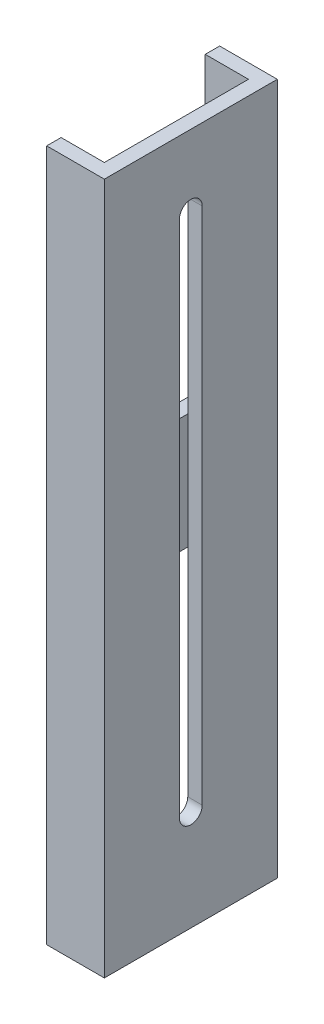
ISO-10303-21;
HEADER;
FILE_DESCRIPTION(('STEP AP214'),'2;1');
FILE_NAME('part.step','',(''),(''),'','','');
FILE_SCHEMA(('AUTOMOTIVE_DESIGN { 1 0 10303 214 1 1 1 1 }'));
ENDSEC;
DATA;
#1=APPLICATION_CONTEXT('core data for automotive mechanical design processes');
#2=APPLICATION_PROTOCOL_DEFINITION('international standard','automotive_design',2000,#1);
#3=PRODUCT_CONTEXT('',#1,'mechanical');
#4=PRODUCT('Part','Part','',(#3));
#5=PRODUCT_RELATED_PRODUCT_CATEGORY('part','',(#4));
#6=PRODUCT_DEFINITION_FORMATION('','',#4);
#7=PRODUCT_DEFINITION_CONTEXT('part definition',#1,'design');
#8=PRODUCT_DEFINITION('design','',#6,#7);
#9=PRODUCT_DEFINITION_SHAPE('','',#8);
#10=(LENGTH_UNIT() NAMED_UNIT(*) SI_UNIT(.MILLI.,.METRE.));
#11=(NAMED_UNIT(*) PLANE_ANGLE_UNIT() SI_UNIT($,.RADIAN.));
#12=(NAMED_UNIT(*) SI_UNIT($,.STERADIAN.) SOLID_ANGLE_UNIT());
#13=UNCERTAINTY_MEASURE_WITH_UNIT(LENGTH_MEASURE(1.E-05),#10,'distance_accuracy_value','');
#14=(GEOMETRIC_REPRESENTATION_CONTEXT(3) GLOBAL_UNCERTAINTY_ASSIGNED_CONTEXT((#13)) GLOBAL_UNIT_ASSIGNED_CONTEXT((#10,
#11,#12)) REPRESENTATION_CONTEXT('',''));
#15=CARTESIAN_POINT('',(0.,0.,0.));
#16=DIRECTION('',(0.,0.,1.));
#17=DIRECTION('',(1.,0.,0.));
#18=AXIS2_PLACEMENT_3D('',#15,#16,#17);
#19=CARTESIAN_POINT('',(-12.7,76.2,-15.875));
#20=DIRECTION('',(0.,0.,-1.));
#21=DIRECTION('',(-1.,0.,0.));
#22=AXIS2_PLACEMENT_3D('',#19,#20,#21);
#23=PLANE('',#22);
#24=DIRECTION('',(-1.,0.,0.));
#25=VECTOR('',#24,1.);
#26=CARTESIAN_POINT('',(-12.7,12.7,-15.875));
#27=LINE('',#26,#25);
#28=CARTESIAN_POINT('',(-9.525,12.7,-15.875));
#29=VERTEX_POINT('',#28);
#30=CARTESIAN_POINT('',(-12.7,12.7,-15.875));
#31=VERTEX_POINT('',#30);
#32=EDGE_CURVE('E57',#29,#31,#27,.T.);
#33=ORIENTED_EDGE('',*,*,#32,.F.);
#34=DIRECTION('',(0.,1.,0.));
#35=VECTOR('',#34,1.);
#36=CARTESIAN_POINT('',(-9.525,76.2,-15.875));
#37=LINE('',#36,#35);
#38=CARTESIAN_POINT('',(-9.525,-12.7,-15.875));
#39=VERTEX_POINT('',#38);
#40=EDGE_CURVE('E285',#39,#29,#37,.T.);
#41=ORIENTED_EDGE('',*,*,#40,.F.);
#42=DIRECTION('',(1.,0.,0.));
#43=VECTOR('',#42,1.);
#44=CARTESIAN_POINT('',(-12.7,-12.7,-15.875));
#45=LINE('',#44,#43);
#46=CARTESIAN_POINT('',(-12.7,-12.7,-15.875));
#47=VERTEX_POINT('',#46);
#48=EDGE_CURVE('E65',#47,#39,#45,.T.);
#49=ORIENTED_EDGE('',*,*,#48,.F.);
#50=DIRECTION('',(0.,-1.,0.));
#51=VECTOR('',#50,1.);
#52=CARTESIAN_POINT('',(-12.7,76.2,-15.875));
#53=LINE('',#52,#51);
#54=CARTESIAN_POINT('',(-12.7,-76.2,-15.875));
#55=VERTEX_POINT('',#54);
#56=EDGE_CURVE('E186',#47,#55,#53,.T.);
#57=ORIENTED_EDGE('',*,*,#56,.T.);
#58=DIRECTION('',(1.,0.,0.));
#59=VECTOR('',#58,1.);
#60=CARTESIAN_POINT('',(-12.7,-76.2,-15.875));
#61=LINE('',#60,#59);
#62=CARTESIAN_POINT('',(-3.175,-76.2,-15.875));
#63=VERTEX_POINT('',#62);
#64=EDGE_CURVE('E213',#55,#63,#61,.T.);
#65=ORIENTED_EDGE('',*,*,#64,.T.);
#66=DIRECTION('',(0.,-1.,0.));
#67=VECTOR('',#66,1.);
#68=CARTESIAN_POINT('',(-3.175,76.2,-15.875));
#69=LINE('',#68,#67);
#70=CARTESIAN_POINT('',(-3.175,76.2,-15.875));
#71=VERTEX_POINT('',#70);
#72=EDGE_CURVE('E182',#71,#63,#69,.T.);
#73=ORIENTED_EDGE('',*,*,#72,.F.);
#74=DIRECTION('',(1.,0.,0.));
#75=VECTOR('',#74,1.);
#76=CARTESIAN_POINT('',(-12.7,76.2,-15.875));
#77=LINE('',#76,#75);
#78=CARTESIAN_POINT('',(-12.7,76.2,-15.875));
#79=VERTEX_POINT('',#78);
#80=EDGE_CURVE('E245',#79,#71,#77,.T.);
#81=ORIENTED_EDGE('',*,*,#80,.F.);
#82=EDGE_CURVE('E188',#79,#31,#53,.T.);
#83=ORIENTED_EDGE('',*,*,#82,.T.);
#84=EDGE_LOOP('',(#33,#41,#49,#57,#65,#73,#81,#83));
#85=FACE_BOUND('',#84,.T.);
#86=ADVANCED_FACE('F41',(#85),#23,.F.);
#87=CARTESIAN_POINT('',(-12.7,76.2,15.875));
#88=DIRECTION('',(0.,0.,1.));
#89=DIRECTION('',(1.,0.,0.));
#90=AXIS2_PLACEMENT_3D('',#87,#88,#89);
#91=PLANE('',#90);
#92=DIRECTION('',(1.,0.,0.));
#93=VECTOR('',#92,1.);
#94=CARTESIAN_POINT('',(-9.525,12.7,15.875));
#95=LINE('',#94,#93);
#96=CARTESIAN_POINT('',(-12.7,12.7,15.875));
#97=VERTEX_POINT('',#96);
#98=CARTESIAN_POINT('',(-9.525,12.7,15.875));
#99=VERTEX_POINT('',#98);
#100=EDGE_CURVE('E160',#97,#99,#95,.T.);
#101=ORIENTED_EDGE('',*,*,#100,.F.);
#102=DIRECTION('',(0.,-1.,0.));
#103=VECTOR('',#102,1.);
#104=CARTESIAN_POINT('',(-12.7,76.2,15.875));
#105=LINE('',#104,#103);
#106=CARTESIAN_POINT('',(-12.7,76.2,15.875));
#107=VERTEX_POINT('',#106);
#108=EDGE_CURVE('E169',#107,#97,#105,.T.);
#109=ORIENTED_EDGE('',*,*,#108,.F.);
#110=DIRECTION('',(-1.,0.,0.));
#111=VECTOR('',#110,1.);
#112=CARTESIAN_POINT('',(-12.7,76.2,15.875));
#113=LINE('',#112,#111);
#114=CARTESIAN_POINT('',(-3.175,76.2,15.875));
#115=VERTEX_POINT('',#114);
#116=EDGE_CURVE('E247',#115,#107,#113,.T.);
#117=ORIENTED_EDGE('',*,*,#116,.F.);
#118=DIRECTION('',(0.,-1.,0.));
#119=VECTOR('',#118,1.);
#120=CARTESIAN_POINT('',(-3.175,76.2,15.875));
#121=LINE('',#120,#119);
#122=CARTESIAN_POINT('',(-3.175,-76.2,15.875));
#123=VERTEX_POINT('',#122);
#124=EDGE_CURVE('E179',#115,#123,#121,.T.);
#125=ORIENTED_EDGE('',*,*,#124,.T.);
#126=DIRECTION('',(-1.,0.,0.));
#127=VECTOR('',#126,1.);
#128=CARTESIAN_POINT('',(-12.7,-76.2,15.875));
#129=LINE('',#128,#127);
#130=CARTESIAN_POINT('',(-12.7,-76.2,15.875));
#131=VERTEX_POINT('',#130);
#132=EDGE_CURVE('E225',#123,#131,#129,.T.);
#133=ORIENTED_EDGE('',*,*,#132,.T.);
#134=CARTESIAN_POINT('',(-12.7,-12.7,15.875));
#135=VERTEX_POINT('',#134);
#136=EDGE_CURVE('E180',#135,#131,#105,.T.);
#137=ORIENTED_EDGE('',*,*,#136,.F.);
#138=DIRECTION('',(-1.,0.,0.));
#139=VECTOR('',#138,1.);
#140=CARTESIAN_POINT('',(-9.525,-12.7,15.875));
#141=LINE('',#140,#139);
#142=CARTESIAN_POINT('',(-9.525,-12.7,15.875));
#143=VERTEX_POINT('',#142);
#144=EDGE_CURVE('E292',#143,#135,#141,.T.);
#145=ORIENTED_EDGE('',*,*,#144,.F.);
#146=DIRECTION('',(0.,-1.,0.));
#147=VECTOR('',#146,1.);
#148=CARTESIAN_POINT('',(-9.525,12.7,15.875));
#149=LINE('',#148,#147);
#150=EDGE_CURVE('E175',#99,#143,#149,.T.);
#151=ORIENTED_EDGE('',*,*,#150,.F.);
#152=EDGE_LOOP('',(#101,#109,#117,#125,#133,#137,#145,#151));
#153=FACE_BOUND('',#152,.T.);
#154=ADVANCED_FACE('F167',(#153),#91,.F.);
#155=CARTESIAN_POINT('',(0.,76.2,19.05));
#156=DIRECTION('',(0.,0.,-1.));
#157=DIRECTION('',(-1.,0.,0.));
#158=AXIS2_PLACEMENT_3D('',#155,#156,#157);
#159=PLANE('',#158);
#160=DIRECTION('',(1.,0.,0.));
#161=VECTOR('',#160,1.);
#162=CARTESIAN_POINT('',(0.,-76.2,19.05));
#163=LINE('',#162,#161);
#164=CARTESIAN_POINT('',(-12.7,-76.2,19.05));
#165=VERTEX_POINT('',#164);
#166=CARTESIAN_POINT('',(0.,-76.2,19.05));
#167=VERTEX_POINT('',#166);
#168=EDGE_CURVE('E214',#165,#167,#163,.T.);
#169=ORIENTED_EDGE('',*,*,#168,.T.);
#170=DIRECTION('',(0.,-1.,0.));
#171=VECTOR('',#170,1.);
#172=CARTESIAN_POINT('',(0.,76.2,19.05));
#173=LINE('',#172,#171);
#174=CARTESIAN_POINT('',(0.,76.2,19.05));
#175=VERTEX_POINT('',#174);
#176=EDGE_CURVE('E11',#175,#167,#173,.T.);
#177=ORIENTED_EDGE('',*,*,#176,.F.);
#178=DIRECTION('',(1.,0.,0.));
#179=VECTOR('',#178,1.);
#180=CARTESIAN_POINT('',(0.,76.2,19.05));
#181=LINE('',#180,#179);
#182=CARTESIAN_POINT('',(-12.7,76.2,19.05));
#183=VERTEX_POINT('',#182);
#184=EDGE_CURVE('E223',#183,#175,#181,.T.);
#185=ORIENTED_EDGE('',*,*,#184,.F.);
#186=DIRECTION('',(0.,-1.,0.));
#187=VECTOR('',#186,1.);
#188=CARTESIAN_POINT('',(-12.7,76.2,19.05));
#189=LINE('',#188,#187);
#190=EDGE_CURVE('E181',#183,#165,#189,.T.);
#191=ORIENTED_EDGE('',*,*,#190,.T.);
#192=EDGE_LOOP('',(#169,#177,#185,#191));
#193=FACE_BOUND('',#192,.T.);
#194=ADVANCED_FACE('F43',(#193),#159,.F.);
#195=CARTESIAN_POINT('',(0.,76.2,-19.05));
#196=DIRECTION('',(-1.,0.,0.));
#197=DIRECTION('',(0.,0.,1.));
#198=AXIS2_PLACEMENT_3D('',#195,#196,#197);
#199=PLANE('',#198);
#200=DIRECTION('',(0.,1.,0.));
#201=VECTOR('',#200,1.);
#202=CARTESIAN_POINT('',(0.,76.2,2.499995));
#203=LINE('',#202,#201);
#204=CARTESIAN_POINT('',(0.,-53.9909884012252,2.499995));
#205=VERTEX_POINT('',#204);
#206=CARTESIAN_POINT('',(0.,60.3090115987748,2.499995));
#207=VERTEX_POINT('',#206);
#208=EDGE_CURVE('E253',#205,#207,#203,.T.);
#209=ORIENTED_EDGE('',*,*,#208,.T.);
#210=CARTESIAN_POINT('',(0.,60.3090115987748,0.));
#211=DIRECTION('',(-1.,0.,0.));
#212=DIRECTION('',(0.,0.,1.));
#213=AXIS2_PLACEMENT_3D('',#210,#211,#212);
#214=CIRCLE('',#213,2.499995);
#215=CARTESIAN_POINT('',(0.,60.3090115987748,-2.499995));
#216=VERTEX_POINT('',#215);
#217=EDGE_CURVE('E237',#207,#216,#214,.T.);
#218=ORIENTED_EDGE('',*,*,#217,.T.);
#219=DIRECTION('',(0.,-1.,0.));
#220=VECTOR('',#219,1.);
#221=CARTESIAN_POINT('',(0.,76.2,-2.499995));
#222=LINE('',#221,#220);
#223=CARTESIAN_POINT('',(0.,-53.9909884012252,-2.499995));
#224=VERTEX_POINT('',#223);
#225=EDGE_CURVE('E260',#216,#224,#222,.T.);
#226=ORIENTED_EDGE('',*,*,#225,.T.);
#227=CARTESIAN_POINT('',(0.,-53.9909884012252,0.));
#228=DIRECTION('',(-1.,0.,0.));
#229=DIRECTION('',(0.,0.,1.));
#230=AXIS2_PLACEMENT_3D('',#227,#228,#229);
#231=CIRCLE('',#230,2.499995);
#232=EDGE_CURVE('E254',#224,#205,#231,.T.);
#233=ORIENTED_EDGE('',*,*,#232,.T.);
#234=EDGE_LOOP('',(#209,#218,#226,#233));
#235=FACE_BOUND('',#234,.T.);
#236=DIRECTION('',(0.,0.,-1.));
#237=VECTOR('',#236,1.);
#238=CARTESIAN_POINT('',(0.,-76.2,-19.05));
#239=LINE('',#238,#237);
#240=CARTESIAN_POINT('',(0.,-76.2,-19.05));
#241=VERTEX_POINT('',#240);
#242=EDGE_CURVE('E208',#167,#241,#239,.T.);
#243=ORIENTED_EDGE('',*,*,#242,.T.);
#244=DIRECTION('',(0.,-1.,0.));
#245=VECTOR('',#244,1.);
#246=CARTESIAN_POINT('',(0.,76.2,-19.05));
#247=LINE('',#246,#245);
#248=CARTESIAN_POINT('',(0.,76.2,-19.05));
#249=VERTEX_POINT('',#248);
#250=EDGE_CURVE('E47',#249,#241,#247,.T.);
#251=ORIENTED_EDGE('',*,*,#250,.F.);
#252=DIRECTION('',(0.,0.,-1.));
#253=VECTOR('',#252,1.);
#254=CARTESIAN_POINT('',(0.,76.2,-19.05));
#255=LINE('',#254,#253);
#256=EDGE_CURVE('E226',#175,#249,#255,.T.);
#257=ORIENTED_EDGE('',*,*,#256,.F.);
#258=ORIENTED_EDGE('',*,*,#176,.T.);
#259=EDGE_LOOP('',(#243,#251,#257,#258));
#260=FACE_BOUND('',#259,.T.);
#261=ADVANCED_FACE('F309',(#235,#260),#199,.F.);
#262=CARTESIAN_POINT('',(0.,76.2,-19.05));
#263=DIRECTION('',(0.,0.,1.));
#264=DIRECTION('',(1.,0.,0.));
#265=AXIS2_PLACEMENT_3D('',#262,#263,#264);
#266=PLANE('',#265);
#267=DIRECTION('',(-1.,0.,0.));
#268=VECTOR('',#267,1.);
#269=CARTESIAN_POINT('',(0.,-76.2,-19.05));
#270=LINE('',#269,#268);
#271=CARTESIAN_POINT('',(-12.7,-76.2,-19.05));
#272=VERTEX_POINT('',#271);
#273=EDGE_CURVE('E203',#241,#272,#270,.T.);
#274=ORIENTED_EDGE('',*,*,#273,.T.);
#275=DIRECTION('',(0.,-1.,0.));
#276=VECTOR('',#275,1.);
#277=CARTESIAN_POINT('',(-12.7,76.2,-19.05));
#278=LINE('',#277,#276);
#279=CARTESIAN_POINT('',(-12.7,76.2,-19.05));
#280=VERTEX_POINT('',#279);
#281=EDGE_CURVE('E194',#280,#272,#278,.T.);
#282=ORIENTED_EDGE('',*,*,#281,.F.);
#283=DIRECTION('',(-1.,0.,0.));
#284=VECTOR('',#283,1.);
#285=CARTESIAN_POINT('',(0.,76.2,-19.05));
#286=LINE('',#285,#284);
#287=EDGE_CURVE('E201',#249,#280,#286,.T.);
#288=ORIENTED_EDGE('',*,*,#287,.F.);
#289=ORIENTED_EDGE('',*,*,#250,.T.);
#290=EDGE_LOOP('',(#274,#282,#288,#289));
#291=FACE_BOUND('',#290,.T.);
#292=ADVANCED_FACE('F200',(#291),#266,.F.);
#293=CARTESIAN_POINT('',(-3.175,76.2,15.875));
#294=DIRECTION('',(1.,0.,0.));
#295=DIRECTION('',(0.,0.,-1.));
#296=AXIS2_PLACEMENT_3D('',#293,#294,#295);
#297=PLANE('',#296);
#298=DIRECTION('',(0.,-1.,0.));
#299=VECTOR('',#298,1.);
#300=CARTESIAN_POINT('',(-3.175,60.3090115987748,-2.499995));
#301=LINE('',#300,#299);
#302=CARTESIAN_POINT('',(-3.175,60.3090115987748,-2.49999499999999));
#303=VERTEX_POINT('',#302);
#304=CARTESIAN_POINT('',(-3.175,-53.9909884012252,-2.499995));
#305=VERTEX_POINT('',#304);
#306=EDGE_CURVE('E277',#303,#305,#301,.T.);
#307=ORIENTED_EDGE('',*,*,#306,.F.);
#308=CARTESIAN_POINT('',(-3.175,60.3090115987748,0.));
#309=DIRECTION('',(-1.,0.,0.));
#310=DIRECTION('',(0.,0.,1.));
#311=AXIS2_PLACEMENT_3D('',#308,#309,#310);
#312=CIRCLE('',#311,2.499995);
#313=CARTESIAN_POINT('',(-3.175,60.3090115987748,2.499995));
#314=VERTEX_POINT('',#313);
#315=EDGE_CURVE('E276',#314,#303,#312,.T.);
#316=ORIENTED_EDGE('',*,*,#315,.F.);
#317=DIRECTION('',(0.,1.,0.));
#318=VECTOR('',#317,1.);
#319=CARTESIAN_POINT('',(-3.175,60.3090115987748,2.499995));
#320=LINE('',#319,#318);
#321=CARTESIAN_POINT('',(-3.175,-53.9909884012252,2.499995));
#322=VERTEX_POINT('',#321);
#323=EDGE_CURVE('E266',#322,#314,#320,.T.);
#324=ORIENTED_EDGE('',*,*,#323,.F.);
#325=CARTESIAN_POINT('',(-3.175,-53.9909884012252,0.));
#326=DIRECTION('',(-1.,0.,0.));
#327=DIRECTION('',(0.,0.,1.));
#328=AXIS2_PLACEMENT_3D('',#325,#326,#327);
#329=CIRCLE('',#328,2.499995);
#330=EDGE_CURVE('E272',#305,#322,#329,.T.);
#331=ORIENTED_EDGE('',*,*,#330,.F.);
#332=EDGE_LOOP('',(#307,#316,#324,#331));
#333=FACE_BOUND('',#332,.T.);
#334=DIRECTION('',(0.,0.,1.));
#335=VECTOR('',#334,1.);
#336=CARTESIAN_POINT('',(-3.175,-76.2,15.875));
#337=LINE('',#336,#335);
#338=EDGE_CURVE('E219',#63,#123,#337,.T.);
#339=ORIENTED_EDGE('',*,*,#338,.T.);
#340=ORIENTED_EDGE('',*,*,#124,.F.);
#341=DIRECTION('',(0.,0.,1.));
#342=VECTOR('',#341,1.);
#343=CARTESIAN_POINT('',(-3.175,76.2,15.875));
#344=LINE('',#343,#342);
#345=EDGE_CURVE('E241',#71,#115,#344,.T.);
#346=ORIENTED_EDGE('',*,*,#345,.F.);
#347=ORIENTED_EDGE('',*,*,#72,.T.);
#348=EDGE_LOOP('',(#339,#340,#346,#347));
#349=FACE_BOUND('',#348,.T.);
#350=ADVANCED_FACE('F303',(#333,#349),#297,.F.);
#351=CARTESIAN_POINT('',(-12.7,76.2,19.05));
#352=DIRECTION('',(1.,0.,0.));
#353=DIRECTION('',(0.,0.,-1.));
#354=AXIS2_PLACEMENT_3D('',#351,#352,#353);
#355=PLANE('',#354);
#356=DIRECTION('',(0.,0.,1.));
#357=VECTOR('',#356,1.);
#358=CARTESIAN_POINT('',(-12.7,-76.2,19.05));
#359=LINE('',#358,#357);
#360=EDGE_CURVE('E221',#131,#165,#359,.T.);
#361=ORIENTED_EDGE('',*,*,#360,.T.);
#362=ORIENTED_EDGE('',*,*,#190,.F.);
#363=DIRECTION('',(0.,0.,1.));
#364=VECTOR('',#363,1.);
#365=CARTESIAN_POINT('',(-12.7,76.2,19.05));
#366=LINE('',#365,#364);
#367=EDGE_CURVE('E177',#107,#183,#366,.T.);
#368=ORIENTED_EDGE('',*,*,#367,.F.);
#369=ORIENTED_EDGE('',*,*,#108,.T.);
#370=DIRECTION('',(0.,0.,1.));
#371=VECTOR('',#370,1.);
#372=CARTESIAN_POINT('',(-12.7,12.7,-19.05));
#373=LINE('',#372,#371);
#374=EDGE_CURVE('E153',#31,#97,#373,.T.);
#375=ORIENTED_EDGE('',*,*,#374,.F.);
#376=ORIENTED_EDGE('',*,*,#82,.F.);
#377=DIRECTION('',(0.,0.,1.));
#378=VECTOR('',#377,1.);
#379=CARTESIAN_POINT('',(-12.7,76.2,-19.05));
#380=LINE('',#379,#378);
#381=EDGE_CURVE('E238',#280,#79,#380,.T.);
#382=ORIENTED_EDGE('',*,*,#381,.F.);
#383=ORIENTED_EDGE('',*,*,#281,.T.);
#384=DIRECTION('',(0.,0.,1.));
#385=VECTOR('',#384,1.);
#386=CARTESIAN_POINT('',(-12.7,-76.2,-19.05));
#387=LINE('',#386,#385);
#388=EDGE_CURVE('E211',#272,#55,#387,.T.);
#389=ORIENTED_EDGE('',*,*,#388,.T.);
#390=ORIENTED_EDGE('',*,*,#56,.F.);
#391=DIRECTION('',(0.,0.,1.));
#392=VECTOR('',#391,1.);
#393=CARTESIAN_POINT('',(-12.7,-12.7,-19.05));
#394=LINE('',#393,#392);
#395=EDGE_CURVE('E290',#47,#135,#394,.T.);
#396=ORIENTED_EDGE('',*,*,#395,.T.);
#397=ORIENTED_EDGE('',*,*,#136,.T.);
#398=EDGE_LOOP('',(#361,#362,#368,#369,#375,#376,#382,#383,#389,#390,#396,#397));
#399=FACE_BOUND('',#398,.T.);
#400=ADVANCED_FACE('F171',(#399),#355,.F.);
#401=CARTESIAN_POINT('',(0.,76.2,0.));
#402=DIRECTION('',(0.,-1.,0.));
#403=DIRECTION('',(0.,0.,-1.));
#404=AXIS2_PLACEMENT_3D('',#401,#402,#403);
#405=PLANE('',#404);
#406=ORIENTED_EDGE('',*,*,#184,.T.);
#407=ORIENTED_EDGE('',*,*,#256,.T.);
#408=ORIENTED_EDGE('',*,*,#287,.T.);
#409=ORIENTED_EDGE('',*,*,#381,.T.);
#410=ORIENTED_EDGE('',*,*,#80,.T.);
#411=ORIENTED_EDGE('',*,*,#345,.T.);
#412=ORIENTED_EDGE('',*,*,#116,.T.);
#413=ORIENTED_EDGE('',*,*,#367,.T.);
#414=EDGE_LOOP('',(#406,#407,#408,#409,#410,#411,#412,#413));
#415=FACE_BOUND('',#414,.T.);
#416=ADVANCED_FACE('F306',(#415),#405,.F.);
#417=CARTESIAN_POINT('',(0.,-76.2,0.));
#418=DIRECTION('',(0.,-1.,0.));
#419=DIRECTION('',(0.,0.,-1.));
#420=AXIS2_PLACEMENT_3D('',#417,#418,#419);
#421=PLANE('',#420);
#422=ORIENTED_EDGE('',*,*,#168,.F.);
#423=ORIENTED_EDGE('',*,*,#360,.F.);
#424=ORIENTED_EDGE('',*,*,#132,.F.);
#425=ORIENTED_EDGE('',*,*,#338,.F.);
#426=ORIENTED_EDGE('',*,*,#64,.F.);
#427=ORIENTED_EDGE('',*,*,#388,.F.);
#428=ORIENTED_EDGE('',*,*,#273,.F.);
#429=ORIENTED_EDGE('',*,*,#242,.F.);
#430=EDGE_LOOP('',(#422,#423,#424,#425,#426,#427,#428,#429));
#431=FACE_BOUND('',#430,.T.);
#432=ADVANCED_FACE('F210',(#431),#421,.T.);
#433=CARTESIAN_POINT('',(149.225,60.3090115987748,0.));
#434=DIRECTION('',(-1.,0.,0.));
#435=DIRECTION('',(0.,0.,1.));
#436=AXIS2_PLACEMENT_3D('',#433,#434,#435);
#437=CYLINDRICAL_SURFACE('',#436,2.499995);
#438=DIRECTION('',(-1.,0.,0.));
#439=VECTOR('',#438,1.);
#440=CARTESIAN_POINT('',(149.225,60.3090115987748,2.499995));
#441=LINE('',#440,#439);
#442=EDGE_CURVE('E261',#207,#314,#441,.T.);
#443=ORIENTED_EDGE('',*,*,#442,.T.);
#444=ORIENTED_EDGE('',*,*,#315,.T.);
#445=DIRECTION('',(-1.,0.,0.));
#446=VECTOR('',#445,1.);
#447=CARTESIAN_POINT('',(149.225,60.3090115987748,-2.499995));
#448=LINE('',#447,#446);
#449=EDGE_CURVE('E265',#216,#303,#448,.T.);
#450=ORIENTED_EDGE('',*,*,#449,.F.);
#451=ORIENTED_EDGE('',*,*,#217,.F.);
#452=EDGE_LOOP('',(#443,#444,#450,#451));
#453=FACE_BOUND('',#452,.T.);
#454=ADVANCED_FACE('F341',(#453),#437,.F.);
#455=CARTESIAN_POINT('',(149.225,60.3090115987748,2.499995));
#456=DIRECTION('',(0.,0.,1.));
#457=DIRECTION('',(1.,0.,0.));
#458=AXIS2_PLACEMENT_3D('',#455,#456,#457);
#459=PLANE('',#458);
#460=DIRECTION('',(-1.,0.,0.));
#461=VECTOR('',#460,1.);
#462=CARTESIAN_POINT('',(149.225,-53.9909884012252,2.499995));
#463=LINE('',#462,#461);
#464=EDGE_CURVE('E268',#205,#322,#463,.T.);
#465=ORIENTED_EDGE('',*,*,#464,.T.);
#466=ORIENTED_EDGE('',*,*,#323,.T.);
#467=ORIENTED_EDGE('',*,*,#442,.F.);
#468=ORIENTED_EDGE('',*,*,#208,.F.);
#469=EDGE_LOOP('',(#465,#466,#467,#468));
#470=FACE_BOUND('',#469,.T.);
#471=ADVANCED_FACE('F350',(#470),#459,.F.);
#472=CARTESIAN_POINT('',(149.225,-53.9909884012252,0.));
#473=DIRECTION('',(-1.,0.,0.));
#474=DIRECTION('',(0.,0.,1.));
#475=AXIS2_PLACEMENT_3D('',#472,#473,#474);
#476=CYLINDRICAL_SURFACE('',#475,2.499995);
#477=DIRECTION('',(-1.,0.,0.));
#478=VECTOR('',#477,1.);
#479=CARTESIAN_POINT('',(149.225,-53.9909884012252,-2.499995));
#480=LINE('',#479,#478);
#481=EDGE_CURVE('E264',#224,#305,#480,.T.);
#482=ORIENTED_EDGE('',*,*,#481,.T.);
#483=ORIENTED_EDGE('',*,*,#330,.T.);
#484=ORIENTED_EDGE('',*,*,#464,.F.);
#485=ORIENTED_EDGE('',*,*,#232,.F.);
#486=EDGE_LOOP('',(#482,#483,#484,#485));
#487=FACE_BOUND('',#486,.T.);
#488=ADVANCED_FACE('F348',(#487),#476,.F.);
#489=CARTESIAN_POINT('',(149.225,60.3090115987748,-2.499995));
#490=DIRECTION('',(0.,0.,-1.));
#491=DIRECTION('',(-1.,0.,0.));
#492=AXIS2_PLACEMENT_3D('',#489,#490,#491);
#493=PLANE('',#492);
#494=ORIENTED_EDGE('',*,*,#449,.T.);
#495=ORIENTED_EDGE('',*,*,#306,.T.);
#496=ORIENTED_EDGE('',*,*,#481,.F.);
#497=ORIENTED_EDGE('',*,*,#225,.F.);
#498=EDGE_LOOP('',(#494,#495,#496,#497));
#499=FACE_BOUND('',#498,.T.);
#500=ADVANCED_FACE('F338',(#499),#493,.F.);
#501=CARTESIAN_POINT('',(-9.525,12.7,-19.05));
#502=DIRECTION('',(0.,-1.,0.));
#503=DIRECTION('',(0.,0.,-1.));
#504=AXIS2_PLACEMENT_3D('',#501,#502,#503);
#505=PLANE('',#504);
#506=DIRECTION('',(0.,0.,1.));
#507=VECTOR('',#506,1.);
#508=CARTESIAN_POINT('',(-9.525,12.7,-19.05));
#509=LINE('',#508,#507);
#510=EDGE_CURVE('E165',#29,#99,#509,.T.);
#511=ORIENTED_EDGE('',*,*,#510,.F.);
#512=ORIENTED_EDGE('',*,*,#32,.T.);
#513=ORIENTED_EDGE('',*,*,#374,.T.);
#514=ORIENTED_EDGE('',*,*,#100,.T.);
#515=EDGE_LOOP('',(#511,#512,#513,#514));
#516=FACE_BOUND('',#515,.T.);
#517=ADVANCED_FACE('F156',(#516),#505,.F.);
#518=CARTESIAN_POINT('',(-9.525,12.7,-19.05));
#519=DIRECTION('',(-1.,0.,0.));
#520=DIRECTION('',(0.,0.,1.));
#521=AXIS2_PLACEMENT_3D('',#518,#519,#520);
#522=PLANE('',#521);
#523=DIRECTION('',(0.,0.,1.));
#524=VECTOR('',#523,1.);
#525=CARTESIAN_POINT('',(-9.525,-12.7,-19.05));
#526=LINE('',#525,#524);
#527=EDGE_CURVE('E287',#39,#143,#526,.T.);
#528=ORIENTED_EDGE('',*,*,#527,.F.);
#529=ORIENTED_EDGE('',*,*,#40,.T.);
#530=ORIENTED_EDGE('',*,*,#510,.T.);
#531=ORIENTED_EDGE('',*,*,#150,.T.);
#532=EDGE_LOOP('',(#528,#529,#530,#531));
#533=FACE_BOUND('',#532,.T.);
#534=ADVANCED_FACE('F293',(#533),#522,.F.);
#535=CARTESIAN_POINT('',(-9.525,-12.7,-19.05));
#536=DIRECTION('',(0.,1.,0.));
#537=DIRECTION('',(0.,0.,1.));
#538=AXIS2_PLACEMENT_3D('',#535,#536,#537);
#539=PLANE('',#538);
#540=ORIENTED_EDGE('',*,*,#395,.F.);
#541=ORIENTED_EDGE('',*,*,#48,.T.);
#542=ORIENTED_EDGE('',*,*,#527,.T.);
#543=ORIENTED_EDGE('',*,*,#144,.T.);
#544=EDGE_LOOP('',(#540,#541,#542,#543));
#545=FACE_BOUND('',#544,.T.);
#546=ADVANCED_FACE('F296',(#545),#539,.F.);
#547=CLOSED_SHELL('',(#86,#154,#194,#261,#292,#350,#400,#416,#432,#454,#471,#488,#500,#517,#534,#546));
#548=MANIFOLD_SOLID_BREP('B2',#547);
#549=ADVANCED_BREP_SHAPE_REPRESENTATION('',(#18,#548),#14);
#550=SHAPE_DEFINITION_REPRESENTATION(#9,#549);
ENDSEC;
END-ISO-10303-21;
